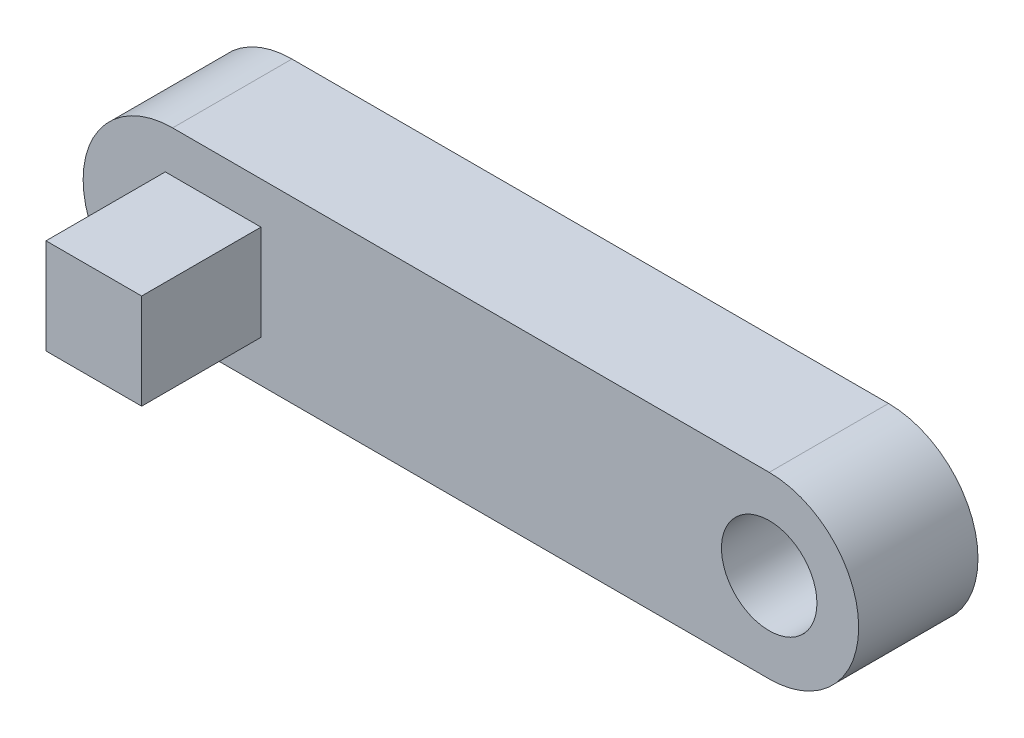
ISO-10303-21;
HEADER;
FILE_DESCRIPTION(('STEP AP214'),'2;1');
FILE_NAME('part.step','',(''),(''),'','','');
FILE_SCHEMA(('AUTOMOTIVE_DESIGN { 1 0 10303 214 1 1 1 1 }'));
ENDSEC;
DATA;
#1=APPLICATION_CONTEXT('core data for automotive mechanical design processes');
#2=APPLICATION_PROTOCOL_DEFINITION('international standard','automotive_design',2000,#1);
#3=PRODUCT_CONTEXT('',#1,'mechanical');
#4=PRODUCT('Part','Part','',(#3));
#5=PRODUCT_RELATED_PRODUCT_CATEGORY('part','',(#4));
#6=PRODUCT_DEFINITION_FORMATION('','',#4);
#7=PRODUCT_DEFINITION_CONTEXT('part definition',#1,'design');
#8=PRODUCT_DEFINITION('design','',#6,#7);
#9=PRODUCT_DEFINITION_SHAPE('','',#8);
#10=(LENGTH_UNIT() NAMED_UNIT(*) SI_UNIT(.MILLI.,.METRE.));
#11=(NAMED_UNIT(*) PLANE_ANGLE_UNIT() SI_UNIT($,.RADIAN.));
#12=(NAMED_UNIT(*) SI_UNIT($,.STERADIAN.) SOLID_ANGLE_UNIT());
#13=UNCERTAINTY_MEASURE_WITH_UNIT(LENGTH_MEASURE(1.E-05),#10,'distance_accuracy_value','');
#14=(GEOMETRIC_REPRESENTATION_CONTEXT(3) GLOBAL_UNCERTAINTY_ASSIGNED_CONTEXT((#13)) GLOBAL_UNIT_ASSIGNED_CONTEXT((#10,
#11,#12)) REPRESENTATION_CONTEXT('',''));
#15=CARTESIAN_POINT('',(0.,0.,0.));
#16=DIRECTION('',(0.,0.,1.));
#17=DIRECTION('',(1.,0.,0.));
#18=AXIS2_PLACEMENT_3D('',#15,#16,#17);
#19=CARTESIAN_POINT('',(132.04046692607,19.05,0.));
#20=DIRECTION('',(0.,0.,-1.));
#21=DIRECTION('',(-1.,0.,0.));
#22=AXIS2_PLACEMENT_3D('',#19,#20,#21);
#23=PLANE('',#22);
#24=CARTESIAN_POINT('',(132.04046692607,19.05,0.));
#25=DIRECTION('',(0.,0.,1.));
#26=DIRECTION('',(-1.,0.,0.));
#27=AXIS2_PLACEMENT_3D('',#24,#25,#26);
#28=CIRCLE('',#27,19.05);
#29=CARTESIAN_POINT('',(132.04046692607,0.,0.));
#30=VERTEX_POINT('',#29);
#31=CARTESIAN_POINT('',(132.04046692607,38.1,0.));
#32=VERTEX_POINT('',#31);
#33=EDGE_CURVE('E448',#30,#32,#28,.T.);
#34=ORIENTED_EDGE('',*,*,#33,.T.);
#35=DIRECTION('',(-1.,0.,0.));
#36=VECTOR('',#35,1.);
#37=CARTESIAN_POINT('',(132.04046692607,38.1,0.));
#38=LINE('',#37,#36);
#39=CARTESIAN_POINT('',(5.04046692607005,38.1,0.));
#40=VERTEX_POINT('',#39);
#41=EDGE_CURVE('E451',#32,#40,#38,.T.);
#42=ORIENTED_EDGE('',*,*,#41,.T.);
#43=CARTESIAN_POINT('',(5.04046692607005,19.05,0.));
#44=DIRECTION('',(0.,0.,1.));
#45=DIRECTION('',(1.,0.,0.));
#46=AXIS2_PLACEMENT_3D('',#43,#44,#45);
#47=CIRCLE('',#46,19.05);
#48=CARTESIAN_POINT('',(5.04046692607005,0.,0.));
#49=VERTEX_POINT('',#48);
#50=EDGE_CURVE('E454',#40,#49,#47,.T.);
#51=ORIENTED_EDGE('',*,*,#50,.T.);
#52=DIRECTION('',(1.,0.,0.));
#53=VECTOR('',#52,1.);
#54=CARTESIAN_POINT('',(132.04046692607,0.,0.));
#55=LINE('',#54,#53);
#56=EDGE_CURVE('E457',#49,#30,#55,.T.);
#57=ORIENTED_EDGE('',*,*,#56,.T.);
#58=EDGE_LOOP('',(#34,#42,#51,#57));
#59=FACE_BOUND('',#58,.T.);
#60=CARTESIAN_POINT('',(132.04046692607,19.05,0.));
#61=DIRECTION('',(0.,0.,1.));
#62=DIRECTION('',(1.,0.,0.));
#63=AXIS2_PLACEMENT_3D('',#60,#61,#62);
#64=CIRCLE('',#63,10.16);
#65=CARTESIAN_POINT('',(142.20046692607,19.05,0.));
#66=VERTEX_POINT('',#65);
#67=EDGE_CURVE('E442',#66,#66,#64,.T.);
#68=ORIENTED_EDGE('',*,*,#67,.F.);
#69=EDGE_LOOP('',(#68));
#70=FACE_BOUND('',#69,.T.);
#71=DIRECTION('',(0.,-1.,0.));
#72=VECTOR('',#71,1.);
#73=CARTESIAN_POINT('',(3.48567007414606,29.21,0.));
#74=LINE('',#73,#72);
#75=CARTESIAN_POINT('',(3.48567007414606,29.21,0.));
#76=VERTEX_POINT('',#75);
#77=CARTESIAN_POINT('',(3.48567007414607,8.89000000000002,0.));
#78=VERTEX_POINT('',#77);
#79=EDGE_CURVE('E410',#76,#78,#74,.T.);
#80=ORIENTED_EDGE('',*,*,#79,.F.);
#81=DIRECTION('',(-1.,0.,0.));
#82=VECTOR('',#81,1.);
#83=CARTESIAN_POINT('',(3.48567007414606,29.21,0.));
#84=LINE('',#83,#82);
#85=CARTESIAN_POINT('',(23.8458688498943,29.21,0.));
#86=VERTEX_POINT('',#85);
#87=EDGE_CURVE('E412',#86,#76,#84,.T.);
#88=ORIENTED_EDGE('',*,*,#87,.F.);
#89=DIRECTION('',(0.,1.,0.));
#90=VECTOR('',#89,1.);
#91=CARTESIAN_POINT('',(23.8458688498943,29.21,0.));
#92=LINE('',#91,#90);
#93=CARTESIAN_POINT('',(23.8458688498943,8.89000000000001,0.));
#94=VERTEX_POINT('',#93);
#95=EDGE_CURVE('E370',#94,#86,#92,.T.);
#96=ORIENTED_EDGE('',*,*,#95,.F.);
#97=DIRECTION('',(1.,0.,0.));
#98=VECTOR('',#97,1.);
#99=CARTESIAN_POINT('',(3.48567007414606,8.89000000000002,0.));
#100=LINE('',#99,#98);
#101=EDGE_CURVE('E365',#78,#94,#100,.T.);
#102=ORIENTED_EDGE('',*,*,#101,.F.);
#103=EDGE_LOOP('',(#80,#88,#96,#102));
#104=FACE_BOUND('',#103,.T.);
#105=ADVANCED_FACE('F348',(#59,#70,#104),#23,.F.);
#106=CARTESIAN_POINT('',(132.04046692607,19.05,-25.4));
#107=DIRECTION('',(0.,0.,1.));
#108=DIRECTION('',(1.,0.,0.));
#109=AXIS2_PLACEMENT_3D('',#106,#107,#108);
#110=CYLINDRICAL_SURFACE('',#109,19.05);
#111=ORIENTED_EDGE('',*,*,#33,.F.);
#112=DIRECTION('',(0.,0.,1.));
#113=VECTOR('',#112,1.);
#114=CARTESIAN_POINT('',(132.04046692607,0.,-25.4));
#115=LINE('',#114,#113);
#116=CARTESIAN_POINT('',(132.04046692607,0.,-25.4));
#117=VERTEX_POINT('',#116);
#118=EDGE_CURVE('E11',#117,#30,#115,.T.);
#119=ORIENTED_EDGE('',*,*,#118,.F.);
#120=CARTESIAN_POINT('',(132.04046692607,19.05,-25.4));
#121=DIRECTION('',(0.,0.,1.));
#122=DIRECTION('',(-1.,0.,0.));
#123=AXIS2_PLACEMENT_3D('',#120,#121,#122);
#124=CIRCLE('',#123,19.05);
#125=CARTESIAN_POINT('',(132.04046692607,38.1,-25.4));
#126=VERTEX_POINT('',#125);
#127=EDGE_CURVE('E460',#117,#126,#124,.T.);
#128=ORIENTED_EDGE('',*,*,#127,.T.);
#129=DIRECTION('',(0.,0.,1.));
#130=VECTOR('',#129,1.);
#131=CARTESIAN_POINT('',(132.04046692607,38.1,-25.4));
#132=LINE('',#131,#130);
#133=EDGE_CURVE('E352',#126,#32,#132,.T.);
#134=ORIENTED_EDGE('',*,*,#133,.T.);
#135=EDGE_LOOP('',(#111,#119,#128,#134));
#136=FACE_BOUND('',#135,.T.);
#137=ADVANCED_FACE('F350',(#136),#110,.T.);
#138=CARTESIAN_POINT('',(132.04046692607,0.,-25.4));
#139=DIRECTION('',(0.,-1.,0.));
#140=DIRECTION('',(1.,0.,0.));
#141=AXIS2_PLACEMENT_3D('',#138,#139,#140);
#142=PLANE('',#141);
#143=ORIENTED_EDGE('',*,*,#56,.F.);
#144=DIRECTION('',(0.,0.,1.));
#145=VECTOR('',#144,1.);
#146=CARTESIAN_POINT('',(5.04046692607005,0.,-25.4));
#147=LINE('',#146,#145);
#148=CARTESIAN_POINT('',(5.04046692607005,0.,-25.4));
#149=VERTEX_POINT('',#148);
#150=EDGE_CURVE('E357',#149,#49,#147,.T.);
#151=ORIENTED_EDGE('',*,*,#150,.F.);
#152=DIRECTION('',(1.,0.,0.));
#153=VECTOR('',#152,1.);
#154=CARTESIAN_POINT('',(132.04046692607,0.,-25.4));
#155=LINE('',#154,#153);
#156=EDGE_CURVE('E469',#149,#117,#155,.T.);
#157=ORIENTED_EDGE('',*,*,#156,.T.);
#158=ORIENTED_EDGE('',*,*,#118,.T.);
#159=EDGE_LOOP('',(#143,#151,#157,#158));
#160=FACE_BOUND('',#159,.T.);
#161=ADVANCED_FACE('F485',(#160),#142,.T.);
#162=CARTESIAN_POINT('',(5.04046692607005,19.05,-25.4));
#163=DIRECTION('',(0.,0.,1.));
#164=DIRECTION('',(1.,0.,0.));
#165=AXIS2_PLACEMENT_3D('',#162,#163,#164);
#166=CYLINDRICAL_SURFACE('',#165,19.05);
#167=ORIENTED_EDGE('',*,*,#50,.F.);
#168=DIRECTION('',(0.,0.,1.));
#169=VECTOR('',#168,1.);
#170=CARTESIAN_POINT('',(5.04046692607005,38.1,-25.4));
#171=LINE('',#170,#169);
#172=CARTESIAN_POINT('',(5.04046692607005,38.1,-25.4));
#173=VERTEX_POINT('',#172);
#174=EDGE_CURVE('E472',#173,#40,#171,.T.);
#175=ORIENTED_EDGE('',*,*,#174,.F.);
#176=CARTESIAN_POINT('',(5.04046692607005,19.05,-25.4));
#177=DIRECTION('',(0.,0.,1.));
#178=DIRECTION('',(1.,0.,0.));
#179=AXIS2_PLACEMENT_3D('',#176,#177,#178);
#180=CIRCLE('',#179,19.05);
#181=EDGE_CURVE('E466',#173,#149,#180,.T.);
#182=ORIENTED_EDGE('',*,*,#181,.T.);
#183=ORIENTED_EDGE('',*,*,#150,.T.);
#184=EDGE_LOOP('',(#167,#175,#182,#183));
#185=FACE_BOUND('',#184,.T.);
#186=ADVANCED_FACE('F491',(#185),#166,.T.);
#187=CARTESIAN_POINT('',(132.04046692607,38.1,-25.4));
#188=DIRECTION('',(0.,1.,0.));
#189=DIRECTION('',(-1.,0.,0.));
#190=AXIS2_PLACEMENT_3D('',#187,#188,#189);
#191=PLANE('',#190);
#192=ORIENTED_EDGE('',*,*,#41,.F.);
#193=ORIENTED_EDGE('',*,*,#133,.F.);
#194=DIRECTION('',(-1.,0.,0.));
#195=VECTOR('',#194,1.);
#196=CARTESIAN_POINT('',(132.04046692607,38.1,-25.4));
#197=LINE('',#196,#195);
#198=EDGE_CURVE('E463',#126,#173,#197,.T.);
#199=ORIENTED_EDGE('',*,*,#198,.T.);
#200=ORIENTED_EDGE('',*,*,#174,.T.);
#201=EDGE_LOOP('',(#192,#193,#199,#200));
#202=FACE_BOUND('',#201,.T.);
#203=ADVANCED_FACE('F480',(#202),#191,.T.);
#204=CARTESIAN_POINT('',(132.04046692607,19.05,-25.4));
#205=DIRECTION('',(0.,0.,-1.));
#206=DIRECTION('',(-1.,0.,0.));
#207=AXIS2_PLACEMENT_3D('',#204,#205,#206);
#208=PLANE('',#207);
#209=CARTESIAN_POINT('',(132.04046692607,19.05,-25.4));
#210=DIRECTION('',(0.,0.,1.));
#211=DIRECTION('',(1.,0.,0.));
#212=AXIS2_PLACEMENT_3D('',#209,#210,#211);
#213=CIRCLE('',#212,10.16);
#214=CARTESIAN_POINT('',(142.20046692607,19.05,-25.4));
#215=VERTEX_POINT('',#214);
#216=EDGE_CURVE('E445',#215,#215,#213,.T.);
#217=ORIENTED_EDGE('',*,*,#216,.T.);
#218=EDGE_LOOP('',(#217));
#219=FACE_BOUND('',#218,.T.);
#220=ORIENTED_EDGE('',*,*,#127,.F.);
#221=ORIENTED_EDGE('',*,*,#156,.F.);
#222=ORIENTED_EDGE('',*,*,#181,.F.);
#223=ORIENTED_EDGE('',*,*,#198,.F.);
#224=EDGE_LOOP('',(#220,#221,#222,#223));
#225=FACE_BOUND('',#224,.T.);
#226=ADVANCED_FACE('F488',(#219,#225),#208,.T.);
#227=CARTESIAN_POINT('',(132.04046692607,19.05,-25.4));
#228=DIRECTION('',(0.,0.,1.));
#229=DIRECTION('',(1.,0.,0.));
#230=AXIS2_PLACEMENT_3D('',#227,#228,#229);
#231=CYLINDRICAL_SURFACE('',#230,10.16);
#232=ORIENTED_EDGE('',*,*,#216,.F.);
#233=EDGE_LOOP('',(#232));
#234=FACE_BOUND('',#233,.T.);
#235=ORIENTED_EDGE('',*,*,#67,.T.);
#236=EDGE_LOOP('',(#235));
#237=FACE_BOUND('',#236,.T.);
#238=ADVANCED_FACE('F506',(#234,#237),#231,.F.);
#239=CARTESIAN_POINT('',(3.48567007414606,29.21,25.4));
#240=DIRECTION('',(1.,0.,0.));
#241=DIRECTION('',(0.,1.,0.));
#242=AXIS2_PLACEMENT_3D('',#239,#240,#241);
#243=PLANE('',#242);
#244=ORIENTED_EDGE('',*,*,#79,.T.);
#245=DIRECTION('',(0.,0.,-1.));
#246=VECTOR('',#245,1.);
#247=CARTESIAN_POINT('',(3.48567007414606,8.89000000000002,25.4));
#248=LINE('',#247,#246);
#249=CARTESIAN_POINT('',(3.48567007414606,8.89000000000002,25.4));
#250=VERTEX_POINT('',#249);
#251=EDGE_CURVE('E440',#250,#78,#248,.T.);
#252=ORIENTED_EDGE('',*,*,#251,.F.);
#253=DIRECTION('',(0.,-1.,0.));
#254=VECTOR('',#253,1.);
#255=CARTESIAN_POINT('',(3.48567007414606,29.21,25.4));
#256=LINE('',#255,#254);
#257=CARTESIAN_POINT('',(3.48567007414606,29.21,25.4));
#258=VERTEX_POINT('',#257);
#259=EDGE_CURVE('E426',#258,#250,#256,.T.);
#260=ORIENTED_EDGE('',*,*,#259,.F.);
#261=DIRECTION('',(0.,0.,-1.));
#262=VECTOR('',#261,1.);
#263=CARTESIAN_POINT('',(3.48567007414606,29.21,25.4));
#264=LINE('',#263,#262);
#265=EDGE_CURVE('E422',#258,#76,#264,.T.);
#266=ORIENTED_EDGE('',*,*,#265,.T.);
#267=EDGE_LOOP('',(#244,#252,#260,#266));
#268=FACE_BOUND('',#267,.T.);
#269=ADVANCED_FACE('F428',(#268),#243,.F.);
#270=CARTESIAN_POINT('',(3.48567007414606,8.89000000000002,25.4));
#271=DIRECTION('',(0.,1.,0.));
#272=DIRECTION('',(-1.,0.,0.));
#273=AXIS2_PLACEMENT_3D('',#270,#271,#272);
#274=PLANE('',#273);
#275=ORIENTED_EDGE('',*,*,#101,.T.);
#276=DIRECTION('',(0.,0.,-1.));
#277=VECTOR('',#276,1.);
#278=CARTESIAN_POINT('',(23.8458688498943,8.89000000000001,25.4));
#279=LINE('',#278,#277);
#280=CARTESIAN_POINT('',(23.8458688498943,8.89000000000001,25.4));
#281=VERTEX_POINT('',#280);
#282=EDGE_CURVE('E432',#281,#94,#279,.T.);
#283=ORIENTED_EDGE('',*,*,#282,.F.);
#284=DIRECTION('',(1.,0.,0.));
#285=VECTOR('',#284,1.);
#286=CARTESIAN_POINT('',(3.48567007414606,8.89000000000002,25.4));
#287=LINE('',#286,#285);
#288=EDGE_CURVE('E538',#250,#281,#287,.T.);
#289=ORIENTED_EDGE('',*,*,#288,.F.);
#290=ORIENTED_EDGE('',*,*,#251,.T.);
#291=EDGE_LOOP('',(#275,#283,#289,#290));
#292=FACE_BOUND('',#291,.T.);
#293=ADVANCED_FACE('F520',(#292),#274,.F.);
#294=CARTESIAN_POINT('',(23.8458688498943,29.21,25.4));
#295=DIRECTION('',(-1.,0.,0.));
#296=DIRECTION('',(0.,0.,1.));
#297=AXIS2_PLACEMENT_3D('',#294,#295,#296);
#298=PLANE('',#297);
#299=ORIENTED_EDGE('',*,*,#95,.T.);
#300=DIRECTION('',(0.,0.,-1.));
#301=VECTOR('',#300,1.);
#302=CARTESIAN_POINT('',(23.8458688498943,29.21,25.4));
#303=LINE('',#302,#301);
#304=CARTESIAN_POINT('',(23.8458688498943,29.21,25.4));
#305=VERTEX_POINT('',#304);
#306=EDGE_CURVE('E425',#305,#86,#303,.T.);
#307=ORIENTED_EDGE('',*,*,#306,.F.);
#308=DIRECTION('',(0.,1.,0.));
#309=VECTOR('',#308,1.);
#310=CARTESIAN_POINT('',(23.8458688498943,29.21,25.4));
#311=LINE('',#310,#309);
#312=EDGE_CURVE('E434',#281,#305,#311,.T.);
#313=ORIENTED_EDGE('',*,*,#312,.F.);
#314=ORIENTED_EDGE('',*,*,#282,.T.);
#315=EDGE_LOOP('',(#299,#307,#313,#314));
#316=FACE_BOUND('',#315,.T.);
#317=ADVANCED_FACE('F524',(#316),#298,.F.);
#318=CARTESIAN_POINT('',(3.48567007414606,29.21,25.4));
#319=DIRECTION('',(0.,-1.,0.));
#320=DIRECTION('',(0.,0.,-1.));
#321=AXIS2_PLACEMENT_3D('',#318,#319,#320);
#322=PLANE('',#321);
#323=ORIENTED_EDGE('',*,*,#87,.T.);
#324=ORIENTED_EDGE('',*,*,#265,.F.);
#325=DIRECTION('',(-1.,0.,0.));
#326=VECTOR('',#325,1.);
#327=CARTESIAN_POINT('',(3.48567007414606,29.21,25.4));
#328=LINE('',#327,#326);
#329=EDGE_CURVE('E430',#305,#258,#328,.T.);
#330=ORIENTED_EDGE('',*,*,#329,.F.);
#331=ORIENTED_EDGE('',*,*,#306,.T.);
#332=EDGE_LOOP('',(#323,#324,#330,#331));
#333=FACE_BOUND('',#332,.T.);
#334=ADVANCED_FACE('F420',(#333),#322,.F.);
#335=CARTESIAN_POINT('',(3.48567007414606,29.21,25.4));
#336=DIRECTION('',(0.,0.,1.));
#337=DIRECTION('',(1.,0.,0.));
#338=AXIS2_PLACEMENT_3D('',#335,#336,#337);
#339=PLANE('',#338);
#340=ORIENTED_EDGE('',*,*,#259,.T.);
#341=ORIENTED_EDGE('',*,*,#288,.T.);
#342=ORIENTED_EDGE('',*,*,#312,.T.);
#343=ORIENTED_EDGE('',*,*,#329,.T.);
#344=EDGE_LOOP('',(#340,#341,#342,#343));
#345=FACE_BOUND('',#344,.T.);
#346=ADVANCED_FACE('F533',(#345),#339,.T.);
#347=CLOSED_SHELL('',(#105,#137,#161,#186,#203,#226,#238,#269,#293,#317,#334,#346));
#348=MANIFOLD_SOLID_BREP('B2',#347);
#349=ADVANCED_BREP_SHAPE_REPRESENTATION('',(#18,#348),#14);
#350=SHAPE_DEFINITION_REPRESENTATION(#9,#349);
ENDSEC;
END-ISO-10303-21;
